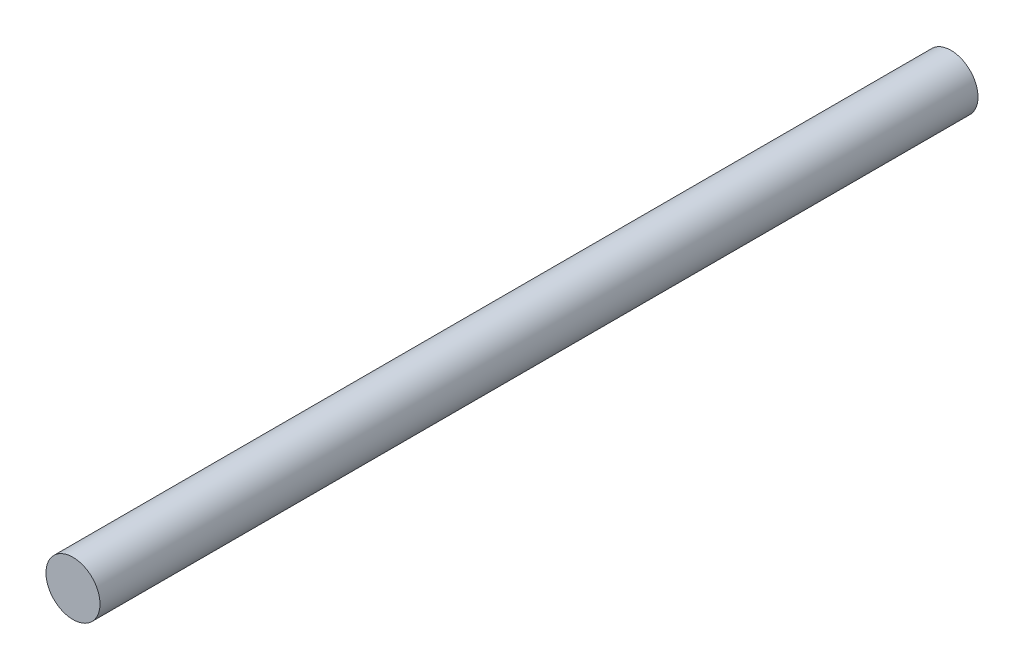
from build123d import *

# Parameters (mm, degrees)
SKETCH1_R           = 4
BOSS_EXTRUDE1_DEPTH = 130


with BuildPart() as part:
    # Sketch1 → Boss-Extrude1 (new body)
    with BuildSketch(Plane.XY):
        Circle(SKETCH1_R)
    extrude(amount=BOSS_EXTRUDE1_DEPTH)


solid = part.part
